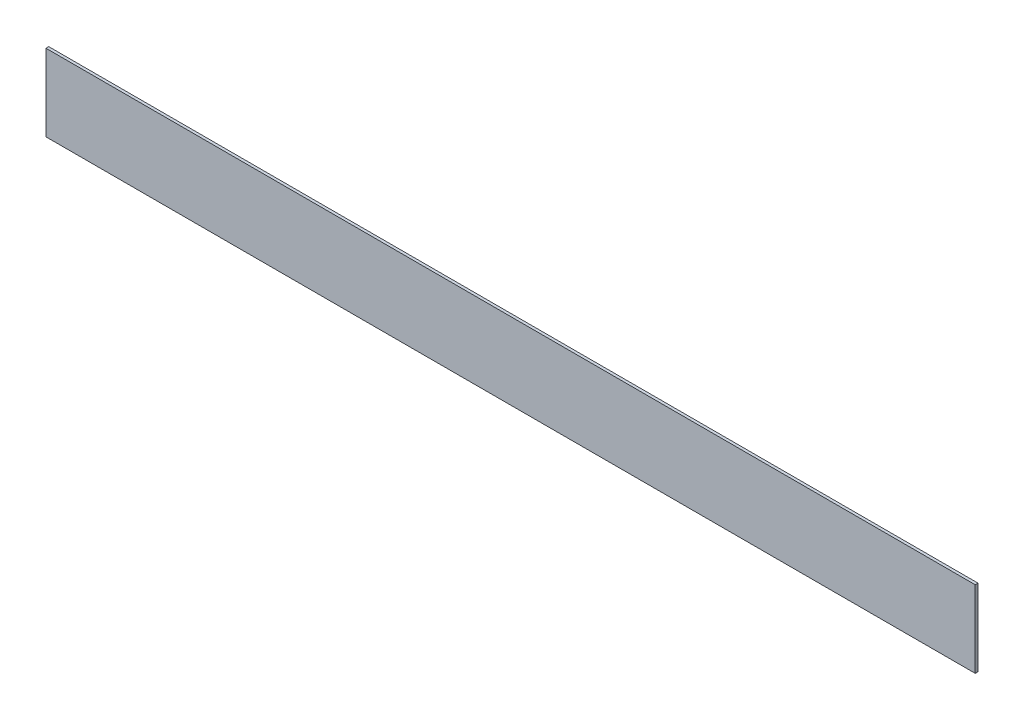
ISO-10303-21;
HEADER;
FILE_DESCRIPTION(('STEP AP214'),'2;1');
FILE_NAME('part.step','',(''),(''),'','','');
FILE_SCHEMA(('AUTOMOTIVE_DESIGN { 1 0 10303 214 1 1 1 1 }'));
ENDSEC;
DATA;
#1=APPLICATION_CONTEXT('core data for automotive mechanical design processes');
#2=APPLICATION_PROTOCOL_DEFINITION('international standard','automotive_design',2000,#1);
#3=PRODUCT_CONTEXT('',#1,'mechanical');
#4=PRODUCT('Part','Part','',(#3));
#5=PRODUCT_RELATED_PRODUCT_CATEGORY('part','',(#4));
#6=PRODUCT_DEFINITION_FORMATION('','',#4);
#7=PRODUCT_DEFINITION_CONTEXT('part definition',#1,'design');
#8=PRODUCT_DEFINITION('design','',#6,#7);
#9=PRODUCT_DEFINITION_SHAPE('','',#8);
#10=(LENGTH_UNIT() NAMED_UNIT(*) SI_UNIT(.MILLI.,.METRE.));
#11=(NAMED_UNIT(*) PLANE_ANGLE_UNIT() SI_UNIT($,.RADIAN.));
#12=(NAMED_UNIT(*) SI_UNIT($,.STERADIAN.) SOLID_ANGLE_UNIT());
#13=UNCERTAINTY_MEASURE_WITH_UNIT(LENGTH_MEASURE(1.E-05),#10,'distance_accuracy_value','');
#14=(GEOMETRIC_REPRESENTATION_CONTEXT(3) GLOBAL_UNCERTAINTY_ASSIGNED_CONTEXT((#13)) GLOBAL_UNIT_ASSIGNED_CONTEXT((#10,
#11,#12)) REPRESENTATION_CONTEXT('',''));
#15=CARTESIAN_POINT('',(0.,0.,0.));
#16=DIRECTION('',(0.,0.,1.));
#17=DIRECTION('',(1.,0.,0.));
#18=AXIS2_PLACEMENT_3D('',#15,#16,#17);
#19=CARTESIAN_POINT('',(-1993.75,553.125,15.));
#20=DIRECTION('',(1.,0.,0.));
#21=DIRECTION('',(0.,1.,0.));
#22=AXIS2_PLACEMENT_3D('',#19,#20,#21);
#23=PLANE('',#22);
#24=DIRECTION('',(0.,-1.,0.));
#25=VECTOR('',#24,1.);
#26=CARTESIAN_POINT('',(-1993.75,553.125,0.));
#27=LINE('',#26,#25);
#28=CARTESIAN_POINT('',(-1993.75,553.125,0.));
#29=VERTEX_POINT('',#28);
#30=CARTESIAN_POINT('',(-1993.75,140.155,0.));
#31=VERTEX_POINT('',#30);
#32=EDGE_CURVE('E95',#29,#31,#27,.T.);
#33=ORIENTED_EDGE('',*,*,#32,.T.);
#34=DIRECTION('',(0.,0.,-1.));
#35=VECTOR('',#34,1.);
#36=CARTESIAN_POINT('',(-1993.75,140.155,15.));
#37=LINE('',#36,#35);
#38=CARTESIAN_POINT('',(-1993.75,140.155,15.));
#39=VERTEX_POINT('',#38);
#40=EDGE_CURVE('E11',#39,#31,#37,.T.);
#41=ORIENTED_EDGE('',*,*,#40,.F.);
#42=DIRECTION('',(0.,-1.,0.));
#43=VECTOR('',#42,1.);
#44=CARTESIAN_POINT('',(-1993.75,553.125,15.));
#45=LINE('',#44,#43);
#46=CARTESIAN_POINT('',(-1993.75,553.125,15.));
#47=VERTEX_POINT('',#46);
#48=EDGE_CURVE('E83',#47,#39,#45,.T.);
#49=ORIENTED_EDGE('',*,*,#48,.F.);
#50=DIRECTION('',(0.,0.,-1.));
#51=VECTOR('',#50,1.);
#52=CARTESIAN_POINT('',(-1993.75,553.125,15.));
#53=LINE('',#52,#51);
#54=EDGE_CURVE('E91',#47,#29,#53,.T.);
#55=ORIENTED_EDGE('',*,*,#54,.T.);
#56=EDGE_LOOP('',(#33,#41,#49,#55));
#57=FACE_BOUND('',#56,.T.);
#58=ADVANCED_FACE('F32',(#57),#23,.F.);
#59=CARTESIAN_POINT('',(-1993.75,140.155,15.));
#60=DIRECTION('',(0.,1.,0.));
#61=DIRECTION('',(0.,0.,1.));
#62=AXIS2_PLACEMENT_3D('',#59,#60,#61);
#63=PLANE('',#62);
#64=DIRECTION('',(1.,0.,0.));
#65=VECTOR('',#64,1.);
#66=CARTESIAN_POINT('',(-1993.75,140.155,0.));
#67=LINE('',#66,#65);
#68=CARTESIAN_POINT('',(3006.25,140.155,0.));
#69=VERTEX_POINT('',#68);
#70=EDGE_CURVE('E87',#31,#69,#67,.T.);
#71=ORIENTED_EDGE('',*,*,#70,.T.);
#72=DIRECTION('',(0.,0.,-1.));
#73=VECTOR('',#72,1.);
#74=CARTESIAN_POINT('',(3006.25,140.155,15.));
#75=LINE('',#74,#73);
#76=CARTESIAN_POINT('',(3006.25,140.155,15.));
#77=VERTEX_POINT('',#76);
#78=EDGE_CURVE('E40',#77,#69,#75,.T.);
#79=ORIENTED_EDGE('',*,*,#78,.F.);
#80=DIRECTION('',(1.,0.,0.));
#81=VECTOR('',#80,1.);
#82=CARTESIAN_POINT('',(-1993.75,140.155,15.));
#83=LINE('',#82,#81);
#84=EDGE_CURVE('E78',#39,#77,#83,.T.);
#85=ORIENTED_EDGE('',*,*,#84,.F.);
#86=ORIENTED_EDGE('',*,*,#40,.T.);
#87=EDGE_LOOP('',(#71,#79,#85,#86));
#88=FACE_BOUND('',#87,.T.);
#89=ADVANCED_FACE('F86',(#88),#63,.F.);
#90=CARTESIAN_POINT('',(3006.25,553.125,15.));
#91=DIRECTION('',(-1.,0.,0.));
#92=DIRECTION('',(0.,0.,1.));
#93=AXIS2_PLACEMENT_3D('',#90,#91,#92);
#94=PLANE('',#93);
#95=DIRECTION('',(0.,1.,0.));
#96=VECTOR('',#95,1.);
#97=CARTESIAN_POINT('',(3006.25,553.125,0.));
#98=LINE('',#97,#96);
#99=CARTESIAN_POINT('',(3006.25,553.125,0.));
#100=VERTEX_POINT('',#99);
#101=EDGE_CURVE('E65',#69,#100,#98,.T.);
#102=ORIENTED_EDGE('',*,*,#101,.T.);
#103=DIRECTION('',(0.,0.,-1.));
#104=VECTOR('',#103,1.);
#105=CARTESIAN_POINT('',(3006.25,553.125,15.));
#106=LINE('',#105,#104);
#107=CARTESIAN_POINT('',(3006.25,553.125,15.));
#108=VERTEX_POINT('',#107);
#109=EDGE_CURVE('E88',#108,#100,#106,.T.);
#110=ORIENTED_EDGE('',*,*,#109,.F.);
#111=DIRECTION('',(0.,1.,0.));
#112=VECTOR('',#111,1.);
#113=CARTESIAN_POINT('',(3006.25,553.125,15.));
#114=LINE('',#113,#112);
#115=EDGE_CURVE('E81',#77,#108,#114,.T.);
#116=ORIENTED_EDGE('',*,*,#115,.F.);
#117=ORIENTED_EDGE('',*,*,#78,.T.);
#118=EDGE_LOOP('',(#102,#110,#116,#117));
#119=FACE_BOUND('',#118,.T.);
#120=ADVANCED_FACE('F89',(#119),#94,.F.);
#121=CARTESIAN_POINT('',(-1993.75,553.125,15.));
#122=DIRECTION('',(0.,-1.,0.));
#123=DIRECTION('',(0.,0.,-1.));
#124=AXIS2_PLACEMENT_3D('',#121,#122,#123);
#125=PLANE('',#124);
#126=DIRECTION('',(-1.,0.,0.));
#127=VECTOR('',#126,1.);
#128=CARTESIAN_POINT('',(-1993.75,553.125,0.));
#129=LINE('',#128,#127);
#130=EDGE_CURVE('E71',#100,#29,#129,.T.);
#131=ORIENTED_EDGE('',*,*,#130,.T.);
#132=ORIENTED_EDGE('',*,*,#54,.F.);
#133=DIRECTION('',(-1.,0.,0.));
#134=VECTOR('',#133,1.);
#135=CARTESIAN_POINT('',(-1993.75,553.125,15.));
#136=LINE('',#135,#134);
#137=EDGE_CURVE('E48',#108,#47,#136,.T.);
#138=ORIENTED_EDGE('',*,*,#137,.F.);
#139=ORIENTED_EDGE('',*,*,#109,.T.);
#140=EDGE_LOOP('',(#131,#132,#138,#139));
#141=FACE_BOUND('',#140,.T.);
#142=ADVANCED_FACE('F102',(#141),#125,.F.);
#143=CARTESIAN_POINT('',(0.,0.,15.));
#144=DIRECTION('',(0.,0.,1.));
#145=DIRECTION('',(1.,0.,0.));
#146=AXIS2_PLACEMENT_3D('',#143,#144,#145);
#147=PLANE('',#146);
#148=ORIENTED_EDGE('',*,*,#48,.T.);
#149=ORIENTED_EDGE('',*,*,#84,.T.);
#150=ORIENTED_EDGE('',*,*,#115,.T.);
#151=ORIENTED_EDGE('',*,*,#137,.T.);
#152=EDGE_LOOP('',(#148,#149,#150,#151));
#153=FACE_BOUND('',#152,.T.);
#154=ADVANCED_FACE('F79',(#153),#147,.T.);
#155=CARTESIAN_POINT('',(0.,0.,0.));
#156=DIRECTION('',(0.,0.,1.));
#157=DIRECTION('',(1.,0.,0.));
#158=AXIS2_PLACEMENT_3D('',#155,#156,#157);
#159=PLANE('',#158);
#160=ORIENTED_EDGE('',*,*,#32,.F.);
#161=ORIENTED_EDGE('',*,*,#130,.F.);
#162=ORIENTED_EDGE('',*,*,#101,.F.);
#163=ORIENTED_EDGE('',*,*,#70,.F.);
#164=EDGE_LOOP('',(#160,#161,#162,#163));
#165=FACE_BOUND('',#164,.T.);
#166=ADVANCED_FACE('F105',(#165),#159,.F.);
#167=CLOSED_SHELL('',(#58,#89,#120,#142,#154,#166));
#168=MANIFOLD_SOLID_BREP('B2',#167);
#169=ADVANCED_BREP_SHAPE_REPRESENTATION('',(#18,#168),#14);
#170=SHAPE_DEFINITION_REPRESENTATION(#9,#169);
ENDSEC;
END-ISO-10303-21;
